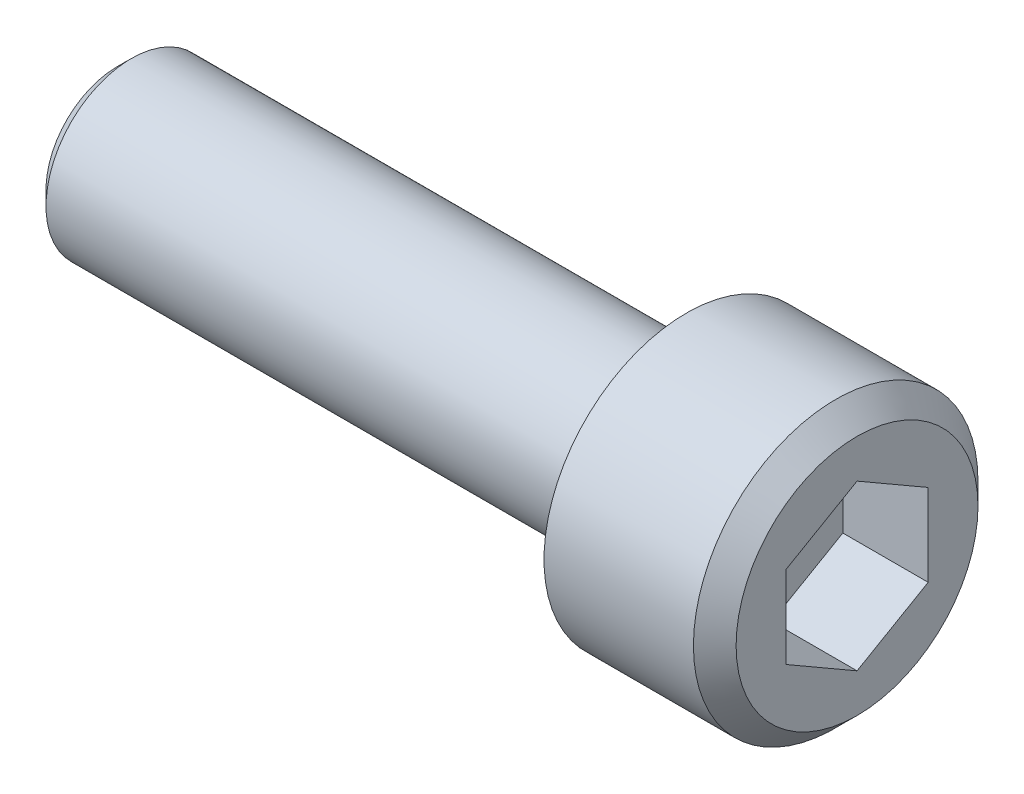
ISO-10303-21;
HEADER;
FILE_DESCRIPTION(('STEP AP214'),'2;1');
FILE_NAME('part.step','',(''),(''),'','','');
FILE_SCHEMA(('AUTOMOTIVE_DESIGN { 1 0 10303 214 1 1 1 1 }'));
ENDSEC;
DATA;
#1=APPLICATION_CONTEXT('core data for automotive mechanical design processes');
#2=APPLICATION_PROTOCOL_DEFINITION('international standard','automotive_design',2000,#1);
#3=PRODUCT_CONTEXT('',#1,'mechanical');
#4=PRODUCT('Part','Part','',(#3));
#5=PRODUCT_RELATED_PRODUCT_CATEGORY('part','',(#4));
#6=PRODUCT_DEFINITION_FORMATION('','',#4);
#7=PRODUCT_DEFINITION_CONTEXT('part definition',#1,'design');
#8=PRODUCT_DEFINITION('design','',#6,#7);
#9=PRODUCT_DEFINITION_SHAPE('','',#8);
#10=(LENGTH_UNIT() NAMED_UNIT(*) SI_UNIT(.MILLI.,.METRE.));
#11=(NAMED_UNIT(*) PLANE_ANGLE_UNIT() SI_UNIT($,.RADIAN.));
#12=(NAMED_UNIT(*) SI_UNIT($,.STERADIAN.) SOLID_ANGLE_UNIT());
#13=UNCERTAINTY_MEASURE_WITH_UNIT(LENGTH_MEASURE(1.E-05),#10,'distance_accuracy_value','');
#14=(GEOMETRIC_REPRESENTATION_CONTEXT(3) GLOBAL_UNCERTAINTY_ASSIGNED_CONTEXT((#13)) GLOBAL_UNIT_ASSIGNED_CONTEXT((#10,
#11,#12)) REPRESENTATION_CONTEXT('',''));
#15=CARTESIAN_POINT('',(0.,0.,0.));
#16=DIRECTION('',(0.,0.,1.));
#17=DIRECTION('',(1.,0.,0.));
#18=AXIS2_PLACEMENT_3D('',#15,#16,#17);
#19=CARTESIAN_POINT('',(23.,0.,0.));
#20=DIRECTION('',(1.,0.,0.));
#21=DIRECTION('',(0.,0.,-1.));
#22=AXIS2_PLACEMENT_3D('',#19,#20,#21);
#23=PLANE('',#22);
#24=DIRECTION('',(0.,-0.5,0.866025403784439));
#25=VECTOR('',#24,1.);
#26=CARTESIAN_POINT('',(23.,2.88675134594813,0.));
#27=LINE('',#26,#25);
#28=CARTESIAN_POINT('',(23.,2.88675134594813,0.));
#29=VERTEX_POINT('',#28);
#30=CARTESIAN_POINT('',(23.,1.44337567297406,2.5));
#31=VERTEX_POINT('',#30);
#32=EDGE_CURVE('E83',#29,#31,#27,.T.);
#33=ORIENTED_EDGE('',*,*,#32,.T.);
#34=DIRECTION('',(0.,1.,0.));
#35=VECTOR('',#34,1.);
#36=CARTESIAN_POINT('',(23.,1.44337567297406,2.5));
#37=LINE('',#36,#35);
#38=CARTESIAN_POINT('',(23.,-1.44337567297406,2.5));
#39=VERTEX_POINT('',#38);
#40=EDGE_CURVE('E67',#31,#39,#37,.F.);
#41=ORIENTED_EDGE('',*,*,#40,.T.);
#42=DIRECTION('',(0.,-0.5,-0.866025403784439));
#43=VECTOR('',#42,1.);
#44=CARTESIAN_POINT('',(23.,-1.44337567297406,2.5));
#45=LINE('',#44,#43);
#46=CARTESIAN_POINT('',(23.,-2.88675134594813,0.));
#47=VERTEX_POINT('',#46);
#48=EDGE_CURVE('E72',#39,#47,#45,.T.);
#49=ORIENTED_EDGE('',*,*,#48,.T.);
#50=DIRECTION('',(0.,0.5,-0.866025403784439));
#51=VECTOR('',#50,1.);
#52=CARTESIAN_POINT('',(23.,-2.88675134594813,0.));
#53=LINE('',#52,#51);
#54=CARTESIAN_POINT('',(23.,-1.44337567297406,-2.5));
#55=VERTEX_POINT('',#54);
#56=EDGE_CURVE('E128',#47,#55,#53,.T.);
#57=ORIENTED_EDGE('',*,*,#56,.T.);
#58=DIRECTION('',(0.,1.,0.));
#59=VECTOR('',#58,1.);
#60=CARTESIAN_POINT('',(23.,-1.44337567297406,-2.5));
#61=LINE('',#60,#59);
#62=CARTESIAN_POINT('',(23.,1.44337567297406,-2.5));
#63=VERTEX_POINT('',#62);
#64=EDGE_CURVE('E132',#55,#63,#61,.T.);
#65=ORIENTED_EDGE('',*,*,#64,.T.);
#66=DIRECTION('',(0.,0.5,0.866025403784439));
#67=VECTOR('',#66,1.);
#68=CARTESIAN_POINT('',(23.,1.44337567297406,-2.5));
#69=LINE('',#68,#67);
#70=EDGE_CURVE('E137',#63,#29,#69,.T.);
#71=ORIENTED_EDGE('',*,*,#70,.T.);
#72=EDGE_LOOP('',(#33,#41,#49,#57,#65,#71));
#73=FACE_BOUND('',#72,.T.);
#74=ADVANCED_FACE('F17',(#73),#23,.T.);
#75=CARTESIAN_POINT('',(26.,-1.44337567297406,2.5));
#76=DIRECTION('',(0.,-0.866025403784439,0.5));
#77=DIRECTION('',(0.,-0.5,-0.866025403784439));
#78=AXIS2_PLACEMENT_3D('',#75,#76,#77);
#79=PLANE('',#78);
#80=DIRECTION('',(1.,0.,0.));
#81=VECTOR('',#80,1.);
#82=CARTESIAN_POINT('',(26.,-1.44337567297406,2.5));
#83=LINE('',#82,#81);
#84=CARTESIAN_POINT('',(26.,-1.44337567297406,2.5));
#85=VERTEX_POINT('',#84);
#86=EDGE_CURVE('E74',#39,#85,#83,.T.);
#87=ORIENTED_EDGE('',*,*,#86,.T.);
#88=DIRECTION('',(0.,0.5,0.866025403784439));
#89=VECTOR('',#88,1.);
#90=CARTESIAN_POINT('',(26.,-2.88675134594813,0.));
#91=LINE('',#90,#89);
#92=CARTESIAN_POINT('',(26.,-2.88675134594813,0.));
#93=VERTEX_POINT('',#92);
#94=EDGE_CURVE('E126',#93,#85,#91,.T.);
#95=ORIENTED_EDGE('',*,*,#94,.F.);
#96=DIRECTION('',(1.,0.,0.));
#97=VECTOR('',#96,1.);
#98=CARTESIAN_POINT('',(26.,-2.88675134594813,0.));
#99=LINE('',#98,#97);
#100=EDGE_CURVE('E77',#93,#47,#99,.F.);
#101=ORIENTED_EDGE('',*,*,#100,.T.);
#102=ORIENTED_EDGE('',*,*,#48,.F.);
#103=EDGE_LOOP('',(#87,#95,#101,#102));
#104=FACE_BOUND('',#103,.T.);
#105=ADVANCED_FACE('F73',(#104),#79,.F.);
#106=CARTESIAN_POINT('',(26.,1.44337567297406,2.5));
#107=DIRECTION('',(0.,0.,1.));
#108=DIRECTION('',(1.,0.,0.));
#109=AXIS2_PLACEMENT_3D('',#106,#107,#108);
#110=PLANE('',#109);
#111=DIRECTION('',(1.,0.,0.));
#112=VECTOR('',#111,1.);
#113=CARTESIAN_POINT('',(26.,1.44337567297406,2.5));
#114=LINE('',#113,#112);
#115=CARTESIAN_POINT('',(26.,1.44337567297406,2.5));
#116=VERTEX_POINT('',#115);
#117=EDGE_CURVE('E85',#31,#116,#114,.T.);
#118=ORIENTED_EDGE('',*,*,#117,.T.);
#119=DIRECTION('',(0.,1.,0.));
#120=VECTOR('',#119,1.);
#121=CARTESIAN_POINT('',(26.,2.125,2.5));
#122=LINE('',#121,#120);
#123=EDGE_CURVE('E89',#85,#116,#122,.T.);
#124=ORIENTED_EDGE('',*,*,#123,.F.);
#125=ORIENTED_EDGE('',*,*,#86,.F.);
#126=ORIENTED_EDGE('',*,*,#40,.F.);
#127=EDGE_LOOP('',(#118,#124,#125,#126));
#128=FACE_BOUND('',#127,.T.);
#129=ADVANCED_FACE('F87',(#128),#110,.F.);
#130=CARTESIAN_POINT('',(26.,2.88675134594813,0.));
#131=DIRECTION('',(0.,0.866025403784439,0.5));
#132=DIRECTION('',(0.,-0.5,0.866025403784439));
#133=AXIS2_PLACEMENT_3D('',#130,#131,#132);
#134=PLANE('',#133);
#135=DIRECTION('',(1.,0.,0.));
#136=VECTOR('',#135,1.);
#137=CARTESIAN_POINT('',(26.,2.88675134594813,0.));
#138=LINE('',#137,#136);
#139=CARTESIAN_POINT('',(26.,2.88675134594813,0.));
#140=VERTEX_POINT('',#139);
#141=EDGE_CURVE('E139',#29,#140,#138,.T.);
#142=ORIENTED_EDGE('',*,*,#141,.T.);
#143=DIRECTION('',(0.,0.5,-0.866025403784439));
#144=VECTOR('',#143,1.);
#145=CARTESIAN_POINT('',(26.,1.44337567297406,2.5));
#146=LINE('',#145,#144);
#147=EDGE_CURVE('E122',#116,#140,#146,.T.);
#148=ORIENTED_EDGE('',*,*,#147,.F.);
#149=ORIENTED_EDGE('',*,*,#117,.F.);
#150=ORIENTED_EDGE('',*,*,#32,.F.);
#151=EDGE_LOOP('',(#142,#148,#149,#150));
#152=FACE_BOUND('',#151,.T.);
#153=ADVANCED_FACE('F143',(#152),#134,.F.);
#154=CARTESIAN_POINT('',(26.,1.44337567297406,-2.5));
#155=DIRECTION('',(0.,0.866025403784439,-0.5));
#156=DIRECTION('',(0.,0.5,0.866025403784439));
#157=AXIS2_PLACEMENT_3D('',#154,#155,#156);
#158=PLANE('',#157);
#159=DIRECTION('',(-1.,0.,0.));
#160=VECTOR('',#159,1.);
#161=CARTESIAN_POINT('',(26.,1.44337567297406,-2.5));
#162=LINE('',#161,#160);
#163=CARTESIAN_POINT('',(26.,1.44337567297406,-2.5));
#164=VERTEX_POINT('',#163);
#165=EDGE_CURVE('E135',#63,#164,#162,.F.);
#166=ORIENTED_EDGE('',*,*,#165,.T.);
#167=DIRECTION('',(0.,-0.5,-0.866025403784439));
#168=VECTOR('',#167,1.);
#169=CARTESIAN_POINT('',(26.,2.88675134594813,0.));
#170=LINE('',#169,#168);
#171=EDGE_CURVE('E119',#140,#164,#170,.T.);
#172=ORIENTED_EDGE('',*,*,#171,.F.);
#173=ORIENTED_EDGE('',*,*,#141,.F.);
#174=ORIENTED_EDGE('',*,*,#70,.F.);
#175=EDGE_LOOP('',(#166,#172,#173,#174));
#176=FACE_BOUND('',#175,.T.);
#177=ADVANCED_FACE('F154',(#176),#158,.F.);
#178=CARTESIAN_POINT('',(26.,-1.44337567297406,-2.5));
#179=DIRECTION('',(0.,0.,-1.));
#180=DIRECTION('',(-1.,0.,0.));
#181=AXIS2_PLACEMENT_3D('',#178,#179,#180);
#182=PLANE('',#181);
#183=DIRECTION('',(1.,0.,0.));
#184=VECTOR('',#183,1.);
#185=CARTESIAN_POINT('',(26.,-1.44337567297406,-2.5));
#186=LINE('',#185,#184);
#187=CARTESIAN_POINT('',(26.,-1.44337567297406,-2.5));
#188=VERTEX_POINT('',#187);
#189=EDGE_CURVE('E35',#55,#188,#186,.T.);
#190=ORIENTED_EDGE('',*,*,#189,.T.);
#191=DIRECTION('',(0.,1.,0.));
#192=VECTOR('',#191,1.);
#193=CARTESIAN_POINT('',(26.,2.125,-2.5));
#194=LINE('',#193,#192);
#195=EDGE_CURVE('E116',#164,#188,#194,.F.);
#196=ORIENTED_EDGE('',*,*,#195,.F.);
#197=ORIENTED_EDGE('',*,*,#165,.F.);
#198=ORIENTED_EDGE('',*,*,#64,.F.);
#199=EDGE_LOOP('',(#190,#196,#197,#198));
#200=FACE_BOUND('',#199,.T.);
#201=ADVANCED_FACE('F152',(#200),#182,.F.);
#202=CARTESIAN_POINT('',(26.,-2.88675134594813,0.));
#203=DIRECTION('',(0.,-0.866025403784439,-0.5));
#204=DIRECTION('',(0.,0.5,-0.866025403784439));
#205=AXIS2_PLACEMENT_3D('',#202,#203,#204);
#206=PLANE('',#205);
#207=ORIENTED_EDGE('',*,*,#100,.F.);
#208=DIRECTION('',(0.,-0.5,0.866025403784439));
#209=VECTOR('',#208,1.);
#210=CARTESIAN_POINT('',(26.,-1.44337567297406,-2.5));
#211=LINE('',#210,#209);
#212=EDGE_CURVE('E108',#188,#93,#211,.T.);
#213=ORIENTED_EDGE('',*,*,#212,.F.);
#214=ORIENTED_EDGE('',*,*,#189,.F.);
#215=ORIENTED_EDGE('',*,*,#56,.F.);
#216=EDGE_LOOP('',(#207,#213,#214,#215));
#217=FACE_BOUND('',#216,.T.);
#218=ADVANCED_FACE('F150',(#217),#206,.F.);
#219=CARTESIAN_POINT('',(26.,2.125,0.));
#220=DIRECTION('',(1.,0.,0.));
#221=DIRECTION('',(0.,0.,-1.));
#222=AXIS2_PLACEMENT_3D('',#219,#220,#221);
#223=PLANE('',#222);
#224=ORIENTED_EDGE('',*,*,#195,.T.);
#225=ORIENTED_EDGE('',*,*,#212,.T.);
#226=ORIENTED_EDGE('',*,*,#94,.T.);
#227=ORIENTED_EDGE('',*,*,#123,.T.);
#228=ORIENTED_EDGE('',*,*,#147,.T.);
#229=ORIENTED_EDGE('',*,*,#171,.T.);
#230=EDGE_LOOP('',(#224,#225,#226,#227,#228,#229));
#231=FACE_BOUND('',#230,.T.);
#232=CARTESIAN_POINT('',(26.0000000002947,0.,0.));
#233=DIRECTION('',(-1.,0.,0.));
#234=DIRECTION('',(0.,0.,1.));
#235=AXIS2_PLACEMENT_3D('',#232,#233,#234);
#236=CIRCLE('',#235,4.2500000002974);
#237=CARTESIAN_POINT('',(26.0000000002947,0.,4.2500000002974));
#238=VERTEX_POINT('',#237);
#239=EDGE_CURVE('E20',#238,#238,#236,.T.);
#240=ORIENTED_EDGE('',*,*,#239,.F.);
#241=EDGE_LOOP('',(#240));
#242=FACE_BOUND('',#241,.T.);
#243=ADVANCED_FACE('F147',(#231,#242),#223,.T.);
#244=CARTESIAN_POINT('',(25.2499999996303,0.,0.));
#245=DIRECTION('',(-1.,0.,0.));
#246=DIRECTION('',(0.,0.,1.));
#247=AXIS2_PLACEMENT_3D('',#244,#245,#246);
#248=CONICAL_SURFACE('',#247,4.99999999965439,0.785398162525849);
#249=CARTESIAN_POINT('',(25.25,0.,0.));
#250=DIRECTION('',(1.,0.,0.));
#251=DIRECTION('',(0.,0.,-1.));
#252=AXIS2_PLACEMENT_3D('',#249,#250,#251);
#253=CIRCLE('',#252,5.);
#254=CARTESIAN_POINT('',(25.25,0.,-5.));
#255=VERTEX_POINT('',#254);
#256=EDGE_CURVE('E100',#255,#255,#253,.F.);
#257=ORIENTED_EDGE('',*,*,#256,.F.);
#258=EDGE_LOOP('',(#257));
#259=FACE_BOUND('',#258,.T.);
#260=ORIENTED_EDGE('',*,*,#239,.T.);
#261=EDGE_LOOP('',(#260));
#262=FACE_BOUND('',#261,.T.);
#263=ADVANCED_FACE('F187',(#259,#262),#248,.T.);
#264=CARTESIAN_POINT('',(22.625,0.,0.));
#265=DIRECTION('',(1.,0.,0.));
#266=DIRECTION('',(0.,0.,-1.));
#267=AXIS2_PLACEMENT_3D('',#264,#265,#266);
#268=CYLINDRICAL_SURFACE('',#267,5.);
#269=CARTESIAN_POINT('',(20.,0.,0.));
#270=DIRECTION('',(1.,0.,0.));
#271=DIRECTION('',(0.,0.,-1.));
#272=AXIS2_PLACEMENT_3D('',#269,#270,#271);
#273=CIRCLE('',#272,5.);
#274=CARTESIAN_POINT('',(20.,0.,-5.));
#275=VERTEX_POINT('',#274);
#276=EDGE_CURVE('E98',#275,#275,#273,.F.);
#277=ORIENTED_EDGE('',*,*,#276,.F.);
#278=EDGE_LOOP('',(#277));
#279=FACE_BOUND('',#278,.T.);
#280=ORIENTED_EDGE('',*,*,#256,.T.);
#281=EDGE_LOOP('',(#280));
#282=FACE_BOUND('',#281,.T.);
#283=ADVANCED_FACE('F183',(#279,#282),#268,.T.);
#284=CARTESIAN_POINT('',(0.,1.25,0.));
#285=DIRECTION('',(-1.,0.,0.));
#286=DIRECTION('',(0.,0.,1.));
#287=AXIS2_PLACEMENT_3D('',#284,#285,#286);
#288=PLANE('',#287);
#289=CARTESIAN_POINT('',(-2.27373675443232E-10,0.,0.));
#290=DIRECTION('',(1.,0.,0.));
#291=DIRECTION('',(0.,0.,-1.));
#292=AXIS2_PLACEMENT_3D('',#289,#290,#291);
#293=CIRCLE('',#292,2.5000000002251);
#294=CARTESIAN_POINT('',(-2.27373675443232E-10,0.,-2.5000000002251));
#295=VERTEX_POINT('',#294);
#296=EDGE_CURVE('E96',#295,#295,#293,.T.);
#297=ORIENTED_EDGE('',*,*,#296,.F.);
#298=EDGE_LOOP('',(#297));
#299=FACE_BOUND('',#298,.T.);
#300=ADVANCED_FACE('F179',(#299),#288,.T.);
#301=CARTESIAN_POINT('',(20.,4.,0.));
#302=DIRECTION('',(-1.,0.,0.));
#303=DIRECTION('',(0.,0.,1.));
#304=AXIS2_PLACEMENT_3D('',#301,#302,#303);
#305=PLANE('',#304);
#306=CARTESIAN_POINT('',(20.,0.,0.));
#307=DIRECTION('',(1.,0.,0.));
#308=DIRECTION('',(0.,0.,-1.));
#309=AXIS2_PLACEMENT_3D('',#306,#307,#308);
#310=CIRCLE('',#309,3.);
#311=CARTESIAN_POINT('',(20.,0.,-3.));
#312=VERTEX_POINT('',#311);
#313=EDGE_CURVE('E26',#312,#312,#310,.F.);
#314=ORIENTED_EDGE('',*,*,#313,.F.);
#315=EDGE_LOOP('',(#314));
#316=FACE_BOUND('',#315,.T.);
#317=ORIENTED_EDGE('',*,*,#276,.T.);
#318=EDGE_LOOP('',(#317));
#319=FACE_BOUND('',#318,.T.);
#320=ADVANCED_FACE('F172',(#316,#319),#305,.T.);
#321=CARTESIAN_POINT('',(0.50000000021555,0.,0.));
#322=DIRECTION('',(1.,0.,0.));
#323=DIRECTION('',(0.,0.,-1.));
#324=AXIS2_PLACEMENT_3D('',#321,#322,#323);
#325=CONICAL_SURFACE('',#324,2.99999999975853,0.785398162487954);
#326=ORIENTED_EDGE('',*,*,#296,.T.);
#327=EDGE_LOOP('',(#326));
#328=FACE_BOUND('',#327,.T.);
#329=CARTESIAN_POINT('',(0.5,0.,0.));
#330=DIRECTION('',(1.,0.,0.));
#331=DIRECTION('',(0.,0.,-1.));
#332=AXIS2_PLACEMENT_3D('',#329,#330,#331);
#333=CIRCLE('',#332,3.);
#334=CARTESIAN_POINT('',(0.5,0.,-3.));
#335=VERTEX_POINT('',#334);
#336=EDGE_CURVE('E11',#335,#335,#333,.T.);
#337=ORIENTED_EDGE('',*,*,#336,.F.);
#338=EDGE_LOOP('',(#337));
#339=FACE_BOUND('',#338,.T.);
#340=ADVANCED_FACE('F166',(#328,#339),#325,.T.);
#341=CARTESIAN_POINT('',(10.25,0.,0.));
#342=DIRECTION('',(1.,0.,0.));
#343=DIRECTION('',(0.,0.,-1.));
#344=AXIS2_PLACEMENT_3D('',#341,#342,#343);
#345=CYLINDRICAL_SURFACE('',#344,3.);
#346=ORIENTED_EDGE('',*,*,#336,.T.);
#347=EDGE_LOOP('',(#346));
#348=FACE_BOUND('',#347,.T.);
#349=ORIENTED_EDGE('',*,*,#313,.T.);
#350=EDGE_LOOP('',(#349));
#351=FACE_BOUND('',#350,.T.);
#352=ADVANCED_FACE('F164',(#348,#351),#345,.T.);
#353=CLOSED_SHELL('',(#74,#105,#129,#153,#177,#201,#218,#243,#263,#283,#300,#320,#340,#352));
#354=MANIFOLD_SOLID_BREP('B1',#353);
#355=ADVANCED_BREP_SHAPE_REPRESENTATION('',(#18,#354),#14);
#356=SHAPE_DEFINITION_REPRESENTATION(#9,#355);
ENDSEC;
END-ISO-10303-21;
